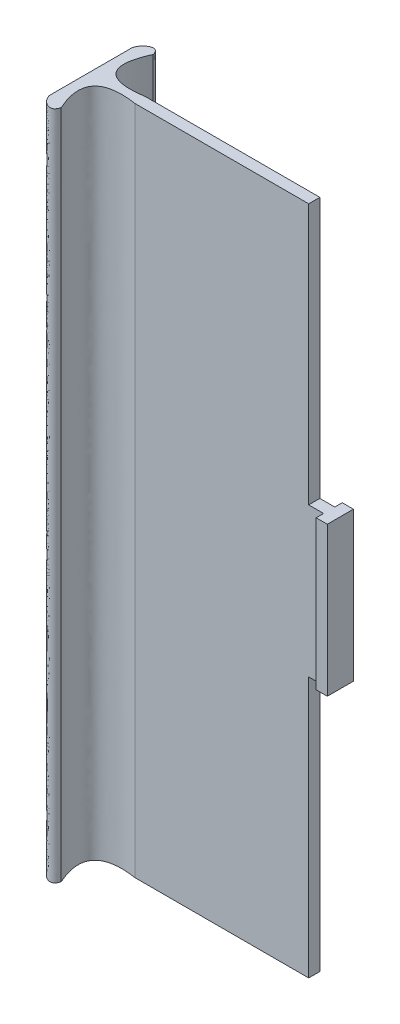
from build123d import *

# Parameters (mm, degrees)
BOSS_EXTRUDE1_DEPTH = 180
BOSS_EXTRUDE2_DEPTH = 20


with BuildPart() as part:
    # Sketch1 → Boss-Extrude1 (new body)
    with BuildSketch(Plane(origin=(0, 0, 0), x_dir=(1, 0, 0), z_dir=(0, 1, 0))):
        with BuildLine():
            Line((0, 0), (0, -3))
            Line((0, -3), (-46.647256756, -3))
            add(Edge.make_bspline(
                [(-46.647256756, -3), (-61.488093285, -0.744329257), (-55.598946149, -13.855627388)],
                knots=[0, 0, 0, 1, 1, 1], degree=2))
            add(Edge.make_bspline(
                [(-55.598946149, -13.855627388), (-56.357258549, -17.223465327), (-60.231193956, -14.216723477), (-60, -12.042995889)],
                knots=[0, 0, 0, 0, 1, 1, 1, 1], degree=3))
            Line((-60, -12.042995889), (-60, 9.042995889))
            add(Edge.make_bspline(
                [(-55.598946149, 10.855627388), (-56.357258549, 14.223465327), (-60.231193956, 11.216723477), (-60, 9.042995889)],
                knots=[0, 0, 0, 0, 1, 1, 1, 1], degree=3))
            add(Edge.make_bspline(
                [(-46.647256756, 0), (-61.488093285, -2.255670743), (-55.598946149, 10.855627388)],
                knots=[0, 0, 0, 1, 1, 1], degree=2))
            Line((-46.647256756, 0), (0, 0))
        make_face()
    extrude(amount=BOSS_EXTRUDE1_DEPTH)

    # Sketch3 → Boss-Extrude2 (add, symmetric)
    with BuildSketch(Plane(origin=(0, 90, 0), x_dir=(1, 0, 0), z_dir=(0, 1, 0))):
        Polygon((4, -3), (4, -5), (7, -5), (7, 2), (4, 2), (4, 0), (0, 0), (0, -3), align=None)
    extrude(amount=BOSS_EXTRUDE2_DEPTH, both=True)


solid = part.part
